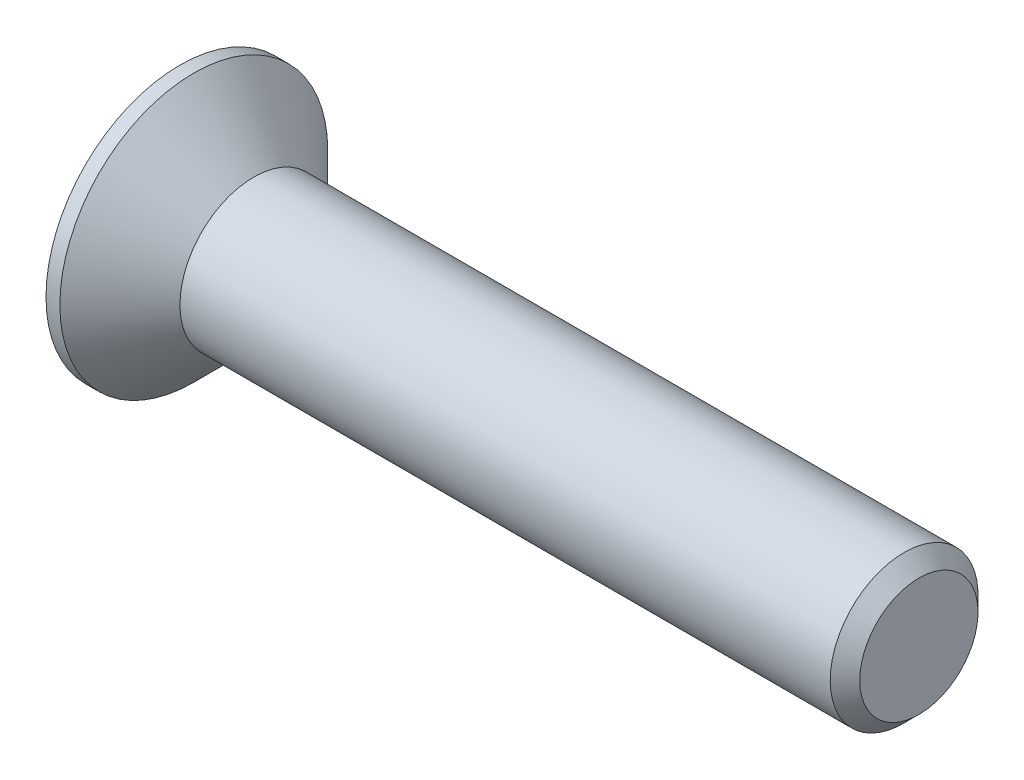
ISO-10303-21;
HEADER;
FILE_DESCRIPTION(('STEP AP214'),'2;1');
FILE_NAME('part.step','',(''),(''),'','','');
FILE_SCHEMA(('AUTOMOTIVE_DESIGN { 1 0 10303 214 1 1 1 1 }'));
ENDSEC;
DATA;
#1=APPLICATION_CONTEXT('core data for automotive mechanical design processes');
#2=APPLICATION_PROTOCOL_DEFINITION('international standard','automotive_design',2000,#1);
#3=PRODUCT_CONTEXT('',#1,'mechanical');
#4=PRODUCT('Part','Part','',(#3));
#5=PRODUCT_RELATED_PRODUCT_CATEGORY('part','',(#4));
#6=PRODUCT_DEFINITION_FORMATION('','',#4);
#7=PRODUCT_DEFINITION_CONTEXT('part definition',#1,'design');
#8=PRODUCT_DEFINITION('design','',#6,#7);
#9=PRODUCT_DEFINITION_SHAPE('','',#8);
#10=(LENGTH_UNIT() NAMED_UNIT(*) SI_UNIT(.MILLI.,.METRE.));
#11=(NAMED_UNIT(*) PLANE_ANGLE_UNIT() SI_UNIT($,.RADIAN.));
#12=(NAMED_UNIT(*) SI_UNIT($,.STERADIAN.) SOLID_ANGLE_UNIT());
#13=UNCERTAINTY_MEASURE_WITH_UNIT(LENGTH_MEASURE(1.E-05),#10,'distance_accuracy_value','');
#14=(GEOMETRIC_REPRESENTATION_CONTEXT(3) GLOBAL_UNCERTAINTY_ASSIGNED_CONTEXT((#13)) GLOBAL_UNIT_ASSIGNED_CONTEXT((#10,
#11,#12)) REPRESENTATION_CONTEXT('',''));
#15=CARTESIAN_POINT('',(0.,0.,0.));
#16=DIRECTION('',(0.,0.,1.));
#17=DIRECTION('',(1.,0.,0.));
#18=AXIS2_PLACEMENT_3D('',#15,#16,#17);
#19=CARTESIAN_POINT('',(0.,0.,0.));
#20=DIRECTION('',(-1.,0.,0.));
#21=DIRECTION('',(0.,0.,1.));
#22=AXIS2_PLACEMENT_3D('',#19,#20,#21);
#23=CONICAL_SURFACE('',#22,4.,0.78539816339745);
#24=CARTESIAN_POINT('',(-3.24999999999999,0.,0.));
#25=DIRECTION('',(-1.,0.,0.));
#26=DIRECTION('',(0.,0.,1.));
#27=AXIS2_PLACEMENT_3D('',#24,#25,#26);
#28=CIRCLE('',#27,7.25);
#29=CARTESIAN_POINT('',(-3.24999999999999,0.,7.25));
#30=VERTEX_POINT('',#29);
#31=EDGE_CURVE('E189',#30,#30,#28,.T.);
#32=ORIENTED_EDGE('',*,*,#31,.F.);
#33=EDGE_LOOP('',(#32));
#34=FACE_BOUND('',#33,.T.);
#35=CARTESIAN_POINT('',(0.,0.,0.));
#36=DIRECTION('',(-1.,0.,0.));
#37=DIRECTION('',(0.,0.,1.));
#38=AXIS2_PLACEMENT_3D('',#35,#36,#37);
#39=CIRCLE('',#38,4.);
#40=CARTESIAN_POINT('',(0.,0.,4.));
#41=VERTEX_POINT('',#40);
#42=EDGE_CURVE('E212',#41,#41,#39,.T.);
#43=ORIENTED_EDGE('',*,*,#42,.T.);
#44=EDGE_LOOP('',(#43));
#45=FACE_BOUND('',#44,.T.);
#46=ADVANCED_FACE('F33',(#34,#45),#23,.T.);
#47=CARTESIAN_POINT('',(-4.,0.,0.));
#48=DIRECTION('',(-1.,0.,0.));
#49=DIRECTION('',(0.,0.,1.));
#50=AXIS2_PLACEMENT_3D('',#47,#48,#49);
#51=CYLINDRICAL_SURFACE('',#50,4.);
#52=CARTESIAN_POINT('',(35.2,0.,0.));
#53=DIRECTION('',(-1.,0.,0.));
#54=DIRECTION('',(0.,0.,1.));
#55=AXIS2_PLACEMENT_3D('',#52,#53,#54);
#56=CIRCLE('',#55,4.);
#57=CARTESIAN_POINT('',(35.2,0.,4.));
#58=VERTEX_POINT('',#57);
#59=EDGE_CURVE('E41',#58,#58,#56,.T.);
#60=ORIENTED_EDGE('',*,*,#59,.T.);
#61=EDGE_LOOP('',(#60));
#62=FACE_BOUND('',#61,.T.);
#63=ORIENTED_EDGE('',*,*,#42,.F.);
#64=EDGE_LOOP('',(#63));
#65=FACE_BOUND('',#64,.T.);
#66=ADVANCED_FACE('F217',(#62,#65),#51,.T.);
#67=CARTESIAN_POINT('',(36.,0.,0.));
#68=DIRECTION('',(-1.,0.,0.));
#69=DIRECTION('',(0.,0.,1.));
#70=AXIS2_PLACEMENT_3D('',#67,#68,#69);
#71=PLANE('',#70);
#72=CARTESIAN_POINT('',(36.,0.,0.));
#73=DIRECTION('',(-1.,0.,0.));
#74=DIRECTION('',(0.,0.,1.));
#75=AXIS2_PLACEMENT_3D('',#72,#73,#74);
#76=CIRCLE('',#75,3.20000000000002);
#77=CARTESIAN_POINT('',(36.,0.,3.20000000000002));
#78=VERTEX_POINT('',#77);
#79=EDGE_CURVE('E11',#78,#78,#76,.F.);
#80=ORIENTED_EDGE('',*,*,#79,.T.);
#81=EDGE_LOOP('',(#80));
#82=FACE_BOUND('',#81,.T.);
#83=ADVANCED_FACE('F239',(#82),#71,.F.);
#84=CARTESIAN_POINT('',(-4.,7.25,0.));
#85=DIRECTION('',(1.,0.,0.));
#86=DIRECTION('',(0.,0.,-1.));
#87=AXIS2_PLACEMENT_3D('',#84,#85,#86);
#88=PLANE('',#87);
#89=DIRECTION('',(0.,0.,-1.));
#90=VECTOR('',#89,1.);
#91=CARTESIAN_POINT('',(-4.,1.09,-4.35));
#92=LINE('',#91,#90);
#93=CARTESIAN_POINT('',(-4.,1.09,-1.09));
#94=VERTEX_POINT('',#93);
#95=CARTESIAN_POINT('',(-4.,1.09,-4.35));
#96=VERTEX_POINT('',#95);
#97=EDGE_CURVE('E158',#94,#96,#92,.T.);
#98=ORIENTED_EDGE('',*,*,#97,.F.);
#99=DIRECTION('',(0.,-1.,0.));
#100=VECTOR('',#99,1.);
#101=CARTESIAN_POINT('',(-4.,1.09,-1.09));
#102=LINE('',#101,#100);
#103=CARTESIAN_POINT('',(-4.,4.35,-1.09));
#104=VERTEX_POINT('',#103);
#105=EDGE_CURVE('E48',#104,#94,#102,.T.);
#106=ORIENTED_EDGE('',*,*,#105,.F.);
#107=DIRECTION('',(0.,0.,-1.));
#108=VECTOR('',#107,1.);
#109=CARTESIAN_POINT('',(-4.,4.35,-1.09));
#110=LINE('',#109,#108);
#111=CARTESIAN_POINT('',(-4.,4.35,1.09));
#112=VERTEX_POINT('',#111);
#113=EDGE_CURVE('E185',#112,#104,#110,.T.);
#114=ORIENTED_EDGE('',*,*,#113,.F.);
#115=DIRECTION('',(0.,1.,0.));
#116=VECTOR('',#115,1.);
#117=CARTESIAN_POINT('',(-4.,4.35,1.09));
#118=LINE('',#117,#116);
#119=CARTESIAN_POINT('',(-4.,1.09,1.09));
#120=VERTEX_POINT('',#119);
#121=EDGE_CURVE('E183',#120,#112,#118,.T.);
#122=ORIENTED_EDGE('',*,*,#121,.F.);
#123=DIRECTION('',(0.,0.,-1.));
#124=VECTOR('',#123,1.);
#125=CARTESIAN_POINT('',(-4.,1.09,1.09));
#126=LINE('',#125,#124);
#127=CARTESIAN_POINT('',(-4.,1.09,4.35));
#128=VERTEX_POINT('',#127);
#129=EDGE_CURVE('E132',#128,#120,#126,.T.);
#130=ORIENTED_EDGE('',*,*,#129,.F.);
#131=DIRECTION('',(0.,1.,0.));
#132=VECTOR('',#131,1.);
#133=CARTESIAN_POINT('',(-4.,1.09,4.35));
#134=LINE('',#133,#132);
#135=CARTESIAN_POINT('',(-4.,-1.09,4.35));
#136=VERTEX_POINT('',#135);
#137=EDGE_CURVE('E179',#136,#128,#134,.T.);
#138=ORIENTED_EDGE('',*,*,#137,.F.);
#139=DIRECTION('',(0.,0.,1.));
#140=VECTOR('',#139,1.);
#141=CARTESIAN_POINT('',(-4.,-1.09,4.35));
#142=LINE('',#141,#140);
#143=CARTESIAN_POINT('',(-4.,-1.09,1.09));
#144=VERTEX_POINT('',#143);
#145=EDGE_CURVE('E176',#144,#136,#142,.T.);
#146=ORIENTED_EDGE('',*,*,#145,.F.);
#147=DIRECTION('',(0.,1.,0.));
#148=VECTOR('',#147,1.);
#149=CARTESIAN_POINT('',(-4.,-1.09,1.09));
#150=LINE('',#149,#148);
#151=CARTESIAN_POINT('',(-4.,-4.35,1.09));
#152=VERTEX_POINT('',#151);
#153=EDGE_CURVE('E173',#152,#144,#150,.T.);
#154=ORIENTED_EDGE('',*,*,#153,.F.);
#155=DIRECTION('',(0.,0.,1.));
#156=VECTOR('',#155,1.);
#157=CARTESIAN_POINT('',(-4.,-4.35,1.09));
#158=LINE('',#157,#156);
#159=CARTESIAN_POINT('',(-4.,-4.35,-1.09));
#160=VERTEX_POINT('',#159);
#161=EDGE_CURVE('E170',#160,#152,#158,.T.);
#162=ORIENTED_EDGE('',*,*,#161,.F.);
#163=DIRECTION('',(0.,-1.,0.));
#164=VECTOR('',#163,1.);
#165=CARTESIAN_POINT('',(-4.,-4.35,-1.09));
#166=LINE('',#165,#164);
#167=CARTESIAN_POINT('',(-4.,-1.09,-1.09));
#168=VERTEX_POINT('',#167);
#169=EDGE_CURVE('E167',#168,#160,#166,.T.);
#170=ORIENTED_EDGE('',*,*,#169,.F.);
#171=DIRECTION('',(0.,0.,1.));
#172=VECTOR('',#171,1.);
#173=CARTESIAN_POINT('',(-4.,-1.09,-1.09));
#174=LINE('',#173,#172);
#175=CARTESIAN_POINT('',(-4.,-1.09,-4.35));
#176=VERTEX_POINT('',#175);
#177=EDGE_CURVE('E164',#176,#168,#174,.T.);
#178=ORIENTED_EDGE('',*,*,#177,.F.);
#179=DIRECTION('',(0.,-1.,0.));
#180=VECTOR('',#179,1.);
#181=CARTESIAN_POINT('',(-4.,-1.09,-4.35));
#182=LINE('',#181,#180);
#183=EDGE_CURVE('E161',#96,#176,#182,.T.);
#184=ORIENTED_EDGE('',*,*,#183,.F.);
#185=EDGE_LOOP('',(#98,#106,#114,#122,#130,#138,#146,#154,#162,#170,#178,#184));
#186=FACE_BOUND('',#185,.T.);
#187=CARTESIAN_POINT('',(-4.,0.,0.));
#188=DIRECTION('',(-1.,0.,0.));
#189=DIRECTION('',(0.,0.,1.));
#190=AXIS2_PLACEMENT_3D('',#187,#188,#189);
#191=CIRCLE('',#190,7.25);
#192=CARTESIAN_POINT('',(-4.,0.,7.25));
#193=VERTEX_POINT('',#192);
#194=EDGE_CURVE('E209',#193,#193,#191,.T.);
#195=ORIENTED_EDGE('',*,*,#194,.T.);
#196=EDGE_LOOP('',(#195));
#197=FACE_BOUND('',#196,.T.);
#198=ADVANCED_FACE('F230',(#186,#197),#88,.F.);
#199=CARTESIAN_POINT('',(-4.,0.,0.));
#200=DIRECTION('',(-1.,0.,0.));
#201=DIRECTION('',(0.,0.,1.));
#202=AXIS2_PLACEMENT_3D('',#199,#200,#201);
#203=CYLINDRICAL_SURFACE('',#202,7.25);
#204=ORIENTED_EDGE('',*,*,#194,.F.);
#205=EDGE_LOOP('',(#204));
#206=FACE_BOUND('',#205,.T.);
#207=ORIENTED_EDGE('',*,*,#31,.T.);
#208=EDGE_LOOP('',(#207));
#209=FACE_BOUND('',#208,.T.);
#210=ADVANCED_FACE('F222',(#206,#209),#203,.T.);
#211=CARTESIAN_POINT('',(35.2,0.,0.));
#212=DIRECTION('',(-1.,0.,0.));
#213=DIRECTION('',(0.,0.,1.));
#214=AXIS2_PLACEMENT_3D('',#211,#212,#213);
#215=CONICAL_SURFACE('',#214,4.,0.785398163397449);
#216=ORIENTED_EDGE('',*,*,#79,.F.);
#217=EDGE_LOOP('',(#216));
#218=FACE_BOUND('',#217,.T.);
#219=ORIENTED_EDGE('',*,*,#59,.F.);
#220=EDGE_LOOP('',(#219));
#221=FACE_BOUND('',#220,.T.);
#222=ADVANCED_FACE('F35',(#218,#221),#215,.T.);
#223=CARTESIAN_POINT('',(-0.55,1.09,-1.09));
#224=DIRECTION('',(0.,0.,-1.));
#225=DIRECTION('',(-1.,0.,0.));
#226=AXIS2_PLACEMENT_3D('',#223,#224,#225);
#227=PLANE('',#226);
#228=ORIENTED_EDGE('',*,*,#105,.T.);
#229=DIRECTION('',(-1.,0.,0.));
#230=VECTOR('',#229,1.);
#231=CARTESIAN_POINT('',(-0.55,1.09,-1.09));
#232=LINE('',#231,#230);
#233=CARTESIAN_POINT('',(-0.55,1.09,-1.09));
#234=VERTEX_POINT('',#233);
#235=EDGE_CURVE('E96',#234,#94,#232,.T.);
#236=ORIENTED_EDGE('',*,*,#235,.F.);
#237=DIRECTION('',(0.,-1.,0.));
#238=VECTOR('',#237,1.);
#239=CARTESIAN_POINT('',(-0.55,1.09,-1.09));
#240=LINE('',#239,#238);
#241=CARTESIAN_POINT('',(-0.55,4.35,-1.09));
#242=VERTEX_POINT('',#241);
#243=EDGE_CURVE('E187',#242,#234,#240,.T.);
#244=ORIENTED_EDGE('',*,*,#243,.F.);
#245=DIRECTION('',(-1.,0.,0.));
#246=VECTOR('',#245,1.);
#247=CARTESIAN_POINT('',(-0.55,4.35,-1.09));
#248=LINE('',#247,#246);
#249=EDGE_CURVE('E56',#242,#104,#248,.T.);
#250=ORIENTED_EDGE('',*,*,#249,.T.);
#251=EDGE_LOOP('',(#228,#236,#244,#250));
#252=FACE_BOUND('',#251,.T.);
#253=ADVANCED_FACE('F221',(#252),#227,.F.);
#254=CARTESIAN_POINT('',(-0.55,4.35,-1.09));
#255=DIRECTION('',(0.,1.,0.));
#256=DIRECTION('',(-1.,0.,0.));
#257=AXIS2_PLACEMENT_3D('',#254,#255,#256);
#258=PLANE('',#257);
#259=ORIENTED_EDGE('',*,*,#113,.T.);
#260=ORIENTED_EDGE('',*,*,#249,.F.);
#261=DIRECTION('',(0.,0.,-1.));
#262=VECTOR('',#261,1.);
#263=CARTESIAN_POINT('',(-0.55,4.35,-1.09));
#264=LINE('',#263,#262);
#265=CARTESIAN_POINT('',(-0.55,4.35,1.09));
#266=VERTEX_POINT('',#265);
#267=EDGE_CURVE('E144',#266,#242,#264,.T.);
#268=ORIENTED_EDGE('',*,*,#267,.F.);
#269=DIRECTION('',(-1.,0.,0.));
#270=VECTOR('',#269,1.);
#271=CARTESIAN_POINT('',(-0.55,4.35,1.09));
#272=LINE('',#271,#270);
#273=EDGE_CURVE('E136',#266,#112,#272,.T.);
#274=ORIENTED_EDGE('',*,*,#273,.T.);
#275=EDGE_LOOP('',(#259,#260,#268,#274));
#276=FACE_BOUND('',#275,.T.);
#277=ADVANCED_FACE('F228',(#276),#258,.F.);
#278=CARTESIAN_POINT('',(-0.55,4.35,1.09));
#279=DIRECTION('',(0.,0.,1.));
#280=DIRECTION('',(1.,0.,0.));
#281=AXIS2_PLACEMENT_3D('',#278,#279,#280);
#282=PLANE('',#281);
#283=ORIENTED_EDGE('',*,*,#121,.T.);
#284=ORIENTED_EDGE('',*,*,#273,.F.);
#285=DIRECTION('',(0.,1.,0.));
#286=VECTOR('',#285,1.);
#287=CARTESIAN_POINT('',(-0.55,4.35,1.09));
#288=LINE('',#287,#286);
#289=CARTESIAN_POINT('',(-0.55,1.09,1.09));
#290=VERTEX_POINT('',#289);
#291=EDGE_CURVE('E140',#290,#266,#288,.T.);
#292=ORIENTED_EDGE('',*,*,#291,.F.);
#293=DIRECTION('',(-1.,0.,0.));
#294=VECTOR('',#293,1.);
#295=CARTESIAN_POINT('',(-0.55,1.09,1.09));
#296=LINE('',#295,#294);
#297=EDGE_CURVE('E125',#290,#120,#296,.T.);
#298=ORIENTED_EDGE('',*,*,#297,.T.);
#299=EDGE_LOOP('',(#283,#284,#292,#298));
#300=FACE_BOUND('',#299,.T.);
#301=ADVANCED_FACE('F141',(#300),#282,.F.);
#302=CARTESIAN_POINT('',(-0.55,1.09,1.09));
#303=DIRECTION('',(0.,1.,0.));
#304=DIRECTION('',(-1.,0.,0.));
#305=AXIS2_PLACEMENT_3D('',#302,#303,#304);
#306=PLANE('',#305);
#307=ORIENTED_EDGE('',*,*,#129,.T.);
#308=ORIENTED_EDGE('',*,*,#297,.F.);
#309=DIRECTION('',(0.,0.,-1.));
#310=VECTOR('',#309,1.);
#311=CARTESIAN_POINT('',(-0.55,1.09,1.09));
#312=LINE('',#311,#310);
#313=CARTESIAN_POINT('',(-0.55,1.09,4.35));
#314=VERTEX_POINT('',#313);
#315=EDGE_CURVE('E129',#314,#290,#312,.T.);
#316=ORIENTED_EDGE('',*,*,#315,.F.);
#317=DIRECTION('',(-1.,0.,0.));
#318=VECTOR('',#317,1.);
#319=CARTESIAN_POINT('',(-0.55,1.09,4.35));
#320=LINE('',#319,#318);
#321=EDGE_CURVE('E137',#314,#128,#320,.T.);
#322=ORIENTED_EDGE('',*,*,#321,.T.);
#323=EDGE_LOOP('',(#307,#308,#316,#322));
#324=FACE_BOUND('',#323,.T.);
#325=ADVANCED_FACE('F127',(#324),#306,.F.);
#326=CARTESIAN_POINT('',(-0.55,1.09,4.35));
#327=DIRECTION('',(0.,0.,1.));
#328=DIRECTION('',(1.,0.,0.));
#329=AXIS2_PLACEMENT_3D('',#326,#327,#328);
#330=PLANE('',#329);
#331=ORIENTED_EDGE('',*,*,#137,.T.);
#332=ORIENTED_EDGE('',*,*,#321,.F.);
#333=DIRECTION('',(0.,1.,0.));
#334=VECTOR('',#333,1.);
#335=CARTESIAN_POINT('',(-0.55,1.09,4.35));
#336=LINE('',#335,#334);
#337=CARTESIAN_POINT('',(-0.55,-1.09,4.35));
#338=VERTEX_POINT('',#337);
#339=EDGE_CURVE('E150',#338,#314,#336,.T.);
#340=ORIENTED_EDGE('',*,*,#339,.F.);
#341=DIRECTION('',(-1.,0.,0.));
#342=VECTOR('',#341,1.);
#343=CARTESIAN_POINT('',(-0.55,-1.09,4.35));
#344=LINE('',#343,#342);
#345=EDGE_CURVE('E192',#338,#136,#344,.T.);
#346=ORIENTED_EDGE('',*,*,#345,.T.);
#347=EDGE_LOOP('',(#331,#332,#340,#346));
#348=FACE_BOUND('',#347,.T.);
#349=ADVANCED_FACE('F277',(#348),#330,.F.);
#350=CARTESIAN_POINT('',(-0.55,-1.09,4.35));
#351=DIRECTION('',(0.,-1.,0.));
#352=DIRECTION('',(1.,0.,0.));
#353=AXIS2_PLACEMENT_3D('',#350,#351,#352);
#354=PLANE('',#353);
#355=ORIENTED_EDGE('',*,*,#145,.T.);
#356=ORIENTED_EDGE('',*,*,#345,.F.);
#357=DIRECTION('',(0.,0.,1.));
#358=VECTOR('',#357,1.);
#359=CARTESIAN_POINT('',(-0.55,-1.09,4.35));
#360=LINE('',#359,#358);
#361=CARTESIAN_POINT('',(-0.55,-1.09,1.09));
#362=VERTEX_POINT('',#361);
#363=EDGE_CURVE('E152',#362,#338,#360,.T.);
#364=ORIENTED_EDGE('',*,*,#363,.F.);
#365=DIRECTION('',(-1.,0.,0.));
#366=VECTOR('',#365,1.);
#367=CARTESIAN_POINT('',(-0.55,-1.09,1.09));
#368=LINE('',#367,#366);
#369=EDGE_CURVE('E194',#362,#144,#368,.T.);
#370=ORIENTED_EDGE('',*,*,#369,.T.);
#371=EDGE_LOOP('',(#355,#356,#364,#370));
#372=FACE_BOUND('',#371,.T.);
#373=ADVANCED_FACE('F273',(#372),#354,.F.);
#374=CARTESIAN_POINT('',(-0.55,-1.09,1.09));
#375=DIRECTION('',(0.,0.,1.));
#376=DIRECTION('',(1.,0.,0.));
#377=AXIS2_PLACEMENT_3D('',#374,#375,#376);
#378=PLANE('',#377);
#379=ORIENTED_EDGE('',*,*,#153,.T.);
#380=ORIENTED_EDGE('',*,*,#369,.F.);
#381=DIRECTION('',(0.,1.,0.));
#382=VECTOR('',#381,1.);
#383=CARTESIAN_POINT('',(-0.55,-1.09,1.09));
#384=LINE('',#383,#382);
#385=CARTESIAN_POINT('',(-0.55,-4.35,1.09));
#386=VERTEX_POINT('',#385);
#387=EDGE_CURVE('E422',#386,#362,#384,.T.);
#388=ORIENTED_EDGE('',*,*,#387,.F.);
#389=DIRECTION('',(-1.,0.,0.));
#390=VECTOR('',#389,1.);
#391=CARTESIAN_POINT('',(-0.55,-4.35,1.09));
#392=LINE('',#391,#390);
#393=EDGE_CURVE('E196',#386,#152,#392,.T.);
#394=ORIENTED_EDGE('',*,*,#393,.T.);
#395=EDGE_LOOP('',(#379,#380,#388,#394));
#396=FACE_BOUND('',#395,.T.);
#397=ADVANCED_FACE('F269',(#396),#378,.F.);
#398=CARTESIAN_POINT('',(-0.55,-4.35,1.09));
#399=DIRECTION('',(0.,-1.,0.));
#400=DIRECTION('',(1.,0.,0.));
#401=AXIS2_PLACEMENT_3D('',#398,#399,#400);
#402=PLANE('',#401);
#403=ORIENTED_EDGE('',*,*,#161,.T.);
#404=ORIENTED_EDGE('',*,*,#393,.F.);
#405=DIRECTION('',(0.,0.,1.));
#406=VECTOR('',#405,1.);
#407=CARTESIAN_POINT('',(-0.55,-4.35,1.09));
#408=LINE('',#407,#406);
#409=CARTESIAN_POINT('',(-0.55,-4.35,-1.09));
#410=VERTEX_POINT('',#409);
#411=EDGE_CURVE('E419',#410,#386,#408,.T.);
#412=ORIENTED_EDGE('',*,*,#411,.F.);
#413=DIRECTION('',(-1.,0.,0.));
#414=VECTOR('',#413,1.);
#415=CARTESIAN_POINT('',(-0.55,-4.35,-1.09));
#416=LINE('',#415,#414);
#417=EDGE_CURVE('E198',#410,#160,#416,.T.);
#418=ORIENTED_EDGE('',*,*,#417,.T.);
#419=EDGE_LOOP('',(#403,#404,#412,#418));
#420=FACE_BOUND('',#419,.T.);
#421=ADVANCED_FACE('F265',(#420),#402,.F.);
#422=CARTESIAN_POINT('',(-0.55,-4.35,-1.09));
#423=DIRECTION('',(0.,0.,-1.));
#424=DIRECTION('',(-1.,0.,0.));
#425=AXIS2_PLACEMENT_3D('',#422,#423,#424);
#426=PLANE('',#425);
#427=ORIENTED_EDGE('',*,*,#169,.T.);
#428=ORIENTED_EDGE('',*,*,#417,.F.);
#429=DIRECTION('',(0.,-1.,0.));
#430=VECTOR('',#429,1.);
#431=CARTESIAN_POINT('',(-0.55,-4.35,-1.09));
#432=LINE('',#431,#430);
#433=CARTESIAN_POINT('',(-0.55,-1.09,-1.09));
#434=VERTEX_POINT('',#433);
#435=EDGE_CURVE('E416',#434,#410,#432,.T.);
#436=ORIENTED_EDGE('',*,*,#435,.F.);
#437=DIRECTION('',(-1.,0.,0.));
#438=VECTOR('',#437,1.);
#439=CARTESIAN_POINT('',(-0.55,-1.09,-1.09));
#440=LINE('',#439,#438);
#441=EDGE_CURVE('E200',#434,#168,#440,.T.);
#442=ORIENTED_EDGE('',*,*,#441,.T.);
#443=EDGE_LOOP('',(#427,#428,#436,#442));
#444=FACE_BOUND('',#443,.T.);
#445=ADVANCED_FACE('F261',(#444),#426,.F.);
#446=CARTESIAN_POINT('',(-0.55,-1.09,-1.09));
#447=DIRECTION('',(0.,-1.,0.));
#448=DIRECTION('',(1.,0.,0.));
#449=AXIS2_PLACEMENT_3D('',#446,#447,#448);
#450=PLANE('',#449);
#451=ORIENTED_EDGE('',*,*,#177,.T.);
#452=ORIENTED_EDGE('',*,*,#441,.F.);
#453=DIRECTION('',(0.,0.,1.));
#454=VECTOR('',#453,1.);
#455=CARTESIAN_POINT('',(-0.55,-1.09,-1.09));
#456=LINE('',#455,#454);
#457=CARTESIAN_POINT('',(-0.55,-1.09,-4.35));
#458=VERTEX_POINT('',#457);
#459=EDGE_CURVE('E413',#458,#434,#456,.T.);
#460=ORIENTED_EDGE('',*,*,#459,.F.);
#461=DIRECTION('',(-1.,0.,0.));
#462=VECTOR('',#461,1.);
#463=CARTESIAN_POINT('',(-0.55,-1.09,-4.35));
#464=LINE('',#463,#462);
#465=EDGE_CURVE('E202',#458,#176,#464,.T.);
#466=ORIENTED_EDGE('',*,*,#465,.T.);
#467=EDGE_LOOP('',(#451,#452,#460,#466));
#468=FACE_BOUND('',#467,.T.);
#469=ADVANCED_FACE('F257',(#468),#450,.F.);
#470=CARTESIAN_POINT('',(-0.55,-1.09,-4.35));
#471=DIRECTION('',(0.,0.,-1.));
#472=DIRECTION('',(-1.,0.,0.));
#473=AXIS2_PLACEMENT_3D('',#470,#471,#472);
#474=PLANE('',#473);
#475=ORIENTED_EDGE('',*,*,#183,.T.);
#476=ORIENTED_EDGE('',*,*,#465,.F.);
#477=DIRECTION('',(0.,-1.,0.));
#478=VECTOR('',#477,1.);
#479=CARTESIAN_POINT('',(-0.55,-1.09,-4.35));
#480=LINE('',#479,#478);
#481=CARTESIAN_POINT('',(-0.55,1.09,-4.35));
#482=VERTEX_POINT('',#481);
#483=EDGE_CURVE('E408',#482,#458,#480,.T.);
#484=ORIENTED_EDGE('',*,*,#483,.F.);
#485=DIRECTION('',(-1.,0.,0.));
#486=VECTOR('',#485,1.);
#487=CARTESIAN_POINT('',(-0.55,1.09,-4.35));
#488=LINE('',#487,#486);
#489=EDGE_CURVE('E204',#482,#96,#488,.T.);
#490=ORIENTED_EDGE('',*,*,#489,.T.);
#491=EDGE_LOOP('',(#475,#476,#484,#490));
#492=FACE_BOUND('',#491,.T.);
#493=ADVANCED_FACE('F253',(#492),#474,.F.);
#494=CARTESIAN_POINT('',(-0.55,1.09,-4.35));
#495=DIRECTION('',(0.,1.,0.));
#496=DIRECTION('',(-1.,0.,0.));
#497=AXIS2_PLACEMENT_3D('',#494,#495,#496);
#498=PLANE('',#497);
#499=ORIENTED_EDGE('',*,*,#97,.T.);
#500=ORIENTED_EDGE('',*,*,#489,.F.);
#501=DIRECTION('',(0.,0.,-1.));
#502=VECTOR('',#501,1.);
#503=CARTESIAN_POINT('',(-0.55,1.09,-4.35));
#504=LINE('',#503,#502);
#505=EDGE_CURVE('E406',#234,#482,#504,.T.);
#506=ORIENTED_EDGE('',*,*,#505,.F.);
#507=ORIENTED_EDGE('',*,*,#235,.T.);
#508=EDGE_LOOP('',(#499,#500,#506,#507));
#509=FACE_BOUND('',#508,.T.);
#510=ADVANCED_FACE('F250',(#509),#498,.F.);
#511=CARTESIAN_POINT('',(-0.55,0.,0.));
#512=DIRECTION('',(1.,0.,0.));
#513=DIRECTION('',(0.,0.,-1.));
#514=AXIS2_PLACEMENT_3D('',#511,#512,#513);
#515=PLANE('',#514);
#516=ORIENTED_EDGE('',*,*,#243,.T.);
#517=ORIENTED_EDGE('',*,*,#505,.T.);
#518=ORIENTED_EDGE('',*,*,#483,.T.);
#519=ORIENTED_EDGE('',*,*,#459,.T.);
#520=ORIENTED_EDGE('',*,*,#435,.T.);
#521=ORIENTED_EDGE('',*,*,#411,.T.);
#522=ORIENTED_EDGE('',*,*,#387,.T.);
#523=ORIENTED_EDGE('',*,*,#363,.T.);
#524=ORIENTED_EDGE('',*,*,#339,.T.);
#525=ORIENTED_EDGE('',*,*,#315,.T.);
#526=ORIENTED_EDGE('',*,*,#291,.T.);
#527=ORIENTED_EDGE('',*,*,#267,.T.);
#528=EDGE_LOOP('',(#516,#517,#518,#519,#520,#521,#522,#523,#524,#525,#526,#527));
#529=FACE_BOUND('',#528,.T.);
#530=ADVANCED_FACE('F147',(#529),#515,.F.);
#531=CLOSED_SHELL('',(#46,#66,#83,#198,#210,#222,#253,#277,#301,#325,#349,#373,#397,#421,#445,
#469,#493,#510,#530));
#532=MANIFOLD_SOLID_BREP('B2',#531);
#533=ADVANCED_BREP_SHAPE_REPRESENTATION('',(#18,#532),#14);
#534=SHAPE_DEFINITION_REPRESENTATION(#9,#533);
ENDSEC;
END-ISO-10303-21;
